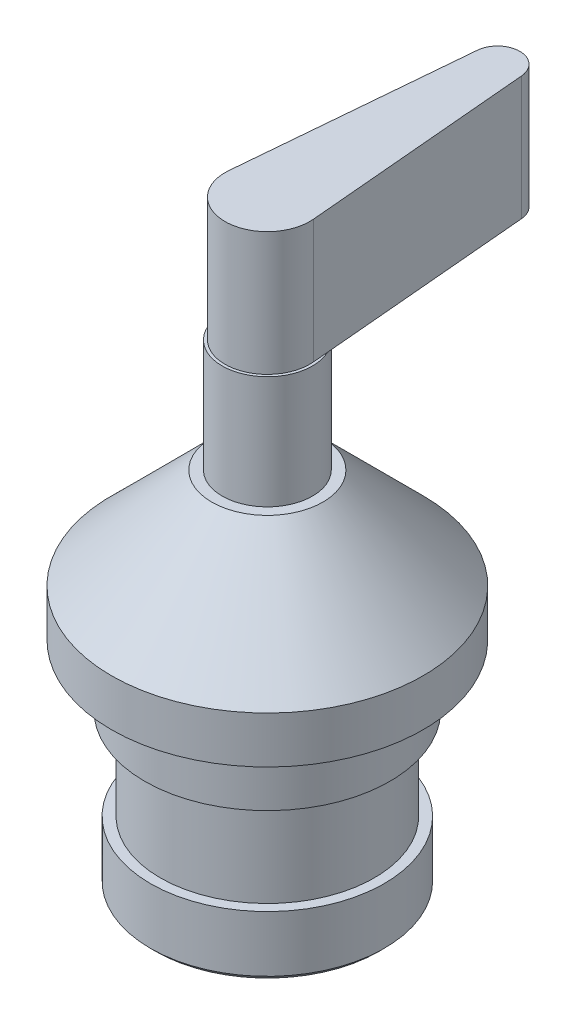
from build123d import *

# Parameters (mm, degrees)
CHAMFER1_SIZE  = 1.27
EXTRUDE1_DEPTH = 30.226


with BuildPart() as part:
    # Sketch1 → Revolve1 (revolve)
    with BuildSketch(Plane.XY, mode=Mode.PRIVATE) as revolve1_sk:
        Polygon((29.972, 0), (29.972, -14.986), (26.162, -14.986), (26.162, -37.338), (28.575, -37.338), (28.575, -52.324), (0, -52.324), (0, 63.5), (11.049, 63.5), (11.049, 35.941), (13.589, 35.941), (38.1, 11.43), (38.1, 0), align=None)
    revolve(revolve1_sk.sketch.rotate(Axis((0, 76.324293, 0), (0, -1, 0)), 90), axis=Axis((0, 76.324293, 0), (0, -1, 0)))

    # Chamfer1
    chamfer1_edges = [part.edges().sort_by_distance(p)[0] for p in [
        (0, -52.324, -28.575),
    ]]
    chamfer(chamfer1_edges, length=CHAMFER1_SIZE)

    # Sketch2 → Extrude1 (add)
    with BuildSketch(Plane(origin=(0, 63.5, 0), x_dir=(-1, 0, 0), z_dir=(0, 1, 0))):
        with BuildLine():
            Line((-10.318354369, -0.905164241), (-5.418755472, -56.7577879))
            ThreePointArc((-5.418755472, -56.7577879), (0, -61.722), (5.418755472, -56.7577879))
            Line((5.418755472, -56.7577879), (10.318354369, -0.905164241))
            ThreePointArc((10.318354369, -0.905164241), (0, 10.357980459), (-10.318354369, -0.905164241))
        make_face()
    extrude(amount=EXTRUDE1_DEPTH)


solid = part.part
